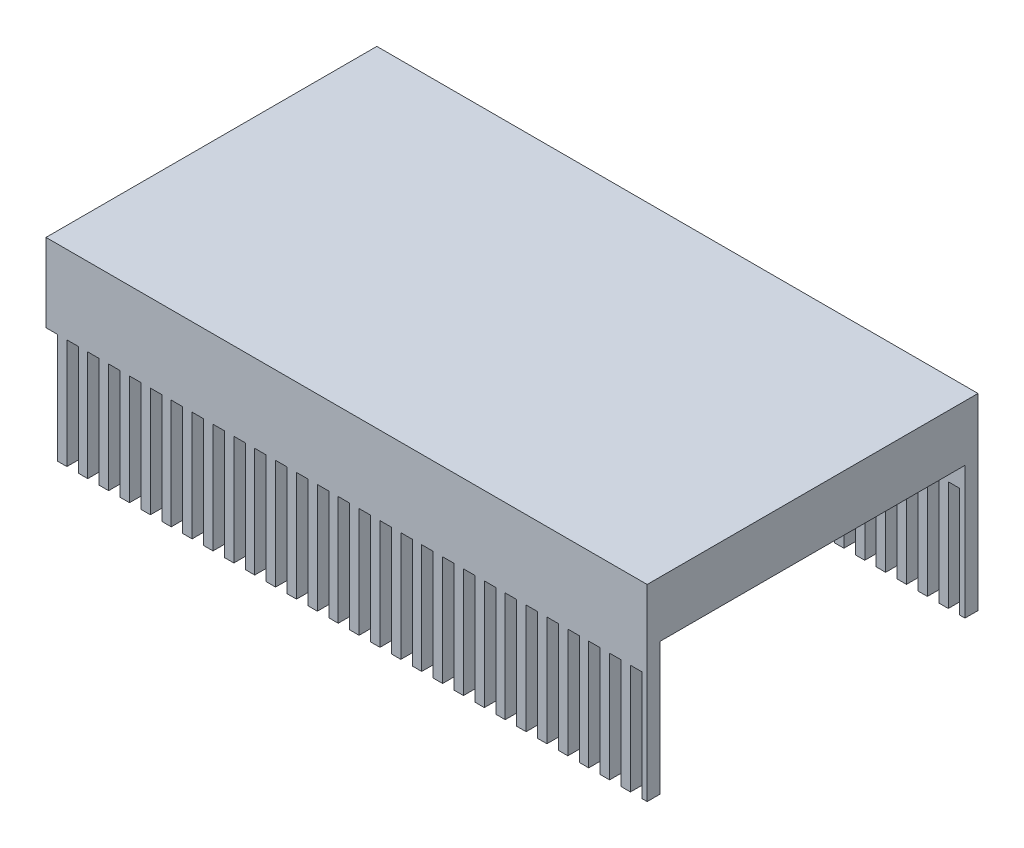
from build123d import *

# Parameters (mm, degrees)
SKETCH1_W           = 36.576
SKETCH1_H           = 20.1295
BOSS_EXTRUDE1_DEPTH = 11.4427
SKETCH2_W           = 18.542
SKETCH2_H           = 8.0518
CUT_EXTRUDE1_DEPTH  = 40.623709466
SKETCH3_W           = 0.698123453
SKETCH3_H           = 6.6802
CUT_EXTRUDE2_DEPTH  = 30.505645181


with BuildPart() as part:
    # Sketch1 → Boss-Extrude1 (new body)
    with BuildSketch(Plane(origin=(0, 0, 0), x_dir=(1, 0, 0), z_dir=(0, 1, 0))):
        Rectangle(SKETCH1_W, SKETCH1_H)
    extrude(amount=BOSS_EXTRUDE1_DEPTH)

    # Sketch2 → Cut-Extrude1 (cut, through all)
    with BuildSketch(Plane(origin=(18.288, 0, 0), x_dir=(0, 0, -1), z_dir=(1, 0, 0))):
        with Locations((0, 4.0259)):
            Rectangle(SKETCH2_W, SKETCH2_H)
    extrude(amount=-CUT_EXTRUDE1_DEPTH, mode=Mode.SUBTRACT)

    # Sketch3 → Cut-Extrude2 (cut, through all)
    with BuildSketch(Plane.XY.offset(10.06475)):
        with Locations((-17.938938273, 3.3401)):
            Rectangle(SKETCH3_W, SKETCH3_H)
        with Locations((-16.668938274, 3.3401)):
            Rectangle(SKETCH3_W, SKETCH3_H)
        with Locations((-15.398938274, 3.3401)):
            Rectangle(SKETCH3_W, SKETCH3_H)
        with Locations((-14.128938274, 3.3401)):
            Rectangle(SKETCH3_W, SKETCH3_H)
        with Locations((-12.858938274, 3.3401)):
            Rectangle(SKETCH3_W, SKETCH3_H)
        with Locations((-11.588938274, 3.3401)):
            Rectangle(SKETCH3_W, SKETCH3_H)
        with Locations((-10.318938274, 3.3401)):
            Rectangle(SKETCH3_W, SKETCH3_H)
        with Locations((-9.048938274, 3.3401)):
            Rectangle(SKETCH3_W, SKETCH3_H)
        with Locations((-7.778938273, 3.3401)):
            Rectangle(SKETCH3_W, SKETCH3_H)
        with Locations((-6.508938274, 3.3401)):
            Rectangle(SKETCH3_W, SKETCH3_H)
        with Locations((-5.238938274, 3.3401)):
            Rectangle(SKETCH3_W, SKETCH3_H)
        with Locations((-3.968938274, 3.3401)):
            Rectangle(SKETCH3_W, SKETCH3_H)
        with Locations((-2.698938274, 3.3401)):
            Rectangle(SKETCH3_W, SKETCH3_H)
        with Locations((-1.428938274, 3.3401)):
            Rectangle(SKETCH3_W, SKETCH3_H)
        with Locations((-0.158938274, 3.3401)):
            Rectangle(SKETCH3_W, SKETCH3_H)
        with Locations((1.111061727, 3.3401)):
            Rectangle(SKETCH3_W, SKETCH3_H)
        with Locations((2.381061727, 3.3401)):
            Rectangle(SKETCH3_W, SKETCH3_H)
        with Locations((3.651061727, 3.3401)):
            Rectangle(SKETCH3_W, SKETCH3_H)
        with Locations((4.921061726, 3.3401)):
            Rectangle(SKETCH3_W, SKETCH3_H)
        with Locations((6.191061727, 3.3401)):
            Rectangle(SKETCH3_W, SKETCH3_H)
        with Locations((7.461061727, 3.3401)):
            Rectangle(SKETCH3_W, SKETCH3_H)
        with Locations((8.731061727, 3.3401)):
            Rectangle(SKETCH3_W, SKETCH3_H)
        with Locations((10.001061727, 3.3401)):
            Rectangle(SKETCH3_W, SKETCH3_H)
        with Locations((11.271061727, 3.3401)):
            Rectangle(SKETCH3_W, SKETCH3_H)
        with Locations((12.541061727, 3.3401)):
            Rectangle(SKETCH3_W, SKETCH3_H)
        with Locations((13.811061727, 3.3401)):
            Rectangle(SKETCH3_W, SKETCH3_H)
        with Locations((15.081061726, 3.3401)):
            Rectangle(SKETCH3_W, SKETCH3_H)
        with Locations((16.351061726, 3.3401)):
            Rectangle(SKETCH3_W, SKETCH3_H)
        with Locations((17.621061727, 3.3401)):
            Rectangle(SKETCH3_W, SKETCH3_H)
        with Locations((18.891061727, 3.3401)):
            Rectangle(SKETCH3_W, SKETCH3_H)
    extrude(amount=-CUT_EXTRUDE2_DEPTH, mode=Mode.SUBTRACT)


solid = part.part
